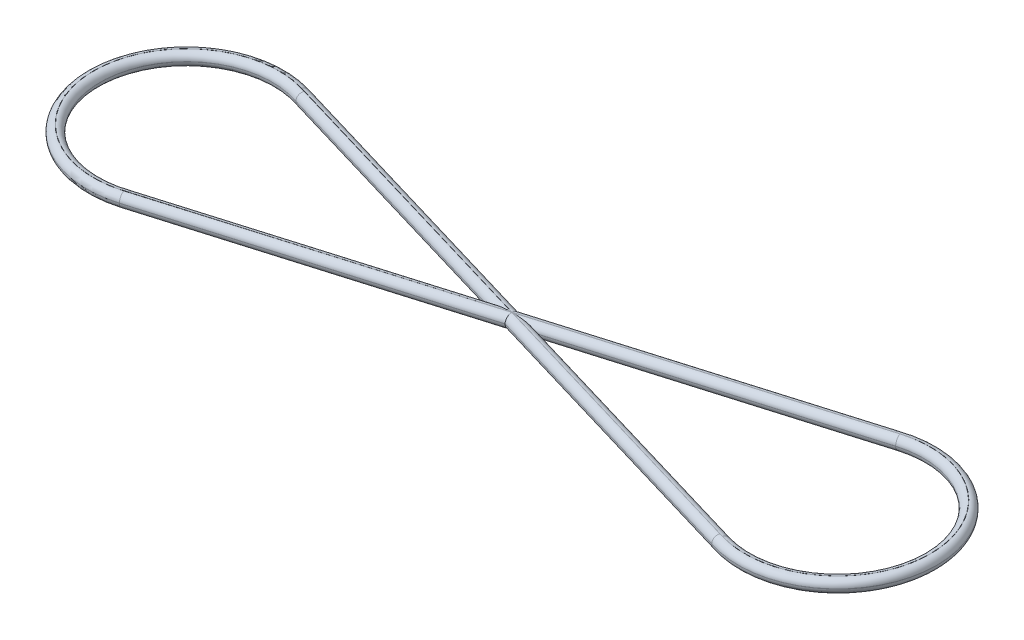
ISO-10303-21;
HEADER;
FILE_DESCRIPTION(('STEP AP214'),'2;1');
FILE_NAME('part.step','',(''),(''),'','','');
FILE_SCHEMA(('AUTOMOTIVE_DESIGN { 1 0 10303 214 1 1 1 1 }'));
ENDSEC;
DATA;
#1=APPLICATION_CONTEXT('core data for automotive mechanical design processes');
#2=APPLICATION_PROTOCOL_DEFINITION('international standard','automotive_design',2000,#1);
#3=PRODUCT_CONTEXT('',#1,'mechanical');
#4=PRODUCT('Part','Part','',(#3));
#5=PRODUCT_RELATED_PRODUCT_CATEGORY('part','',(#4));
#6=PRODUCT_DEFINITION_FORMATION('','',#4);
#7=PRODUCT_DEFINITION_CONTEXT('part definition',#1,'design');
#8=PRODUCT_DEFINITION('design','',#6,#7);
#9=PRODUCT_DEFINITION_SHAPE('','',#8);
#10=(LENGTH_UNIT() NAMED_UNIT(*) SI_UNIT(.MILLI.,.METRE.));
#11=(NAMED_UNIT(*) PLANE_ANGLE_UNIT() SI_UNIT($,.RADIAN.));
#12=(NAMED_UNIT(*) SI_UNIT($,.STERADIAN.) SOLID_ANGLE_UNIT());
#13=UNCERTAINTY_MEASURE_WITH_UNIT(LENGTH_MEASURE(1.E-05),#10,'distance_accuracy_value','');
#14=(GEOMETRIC_REPRESENTATION_CONTEXT(3) GLOBAL_UNCERTAINTY_ASSIGNED_CONTEXT((#13)) GLOBAL_UNIT_ASSIGNED_CONTEXT((#10,
#11,#12)) REPRESENTATION_CONTEXT('',''));
#15=CARTESIAN_POINT('',(0.,0.,0.));
#16=DIRECTION('',(0.,0.,1.));
#17=DIRECTION('',(1.,0.,0.));
#18=AXIS2_PLACEMENT_3D('',#15,#16,#17);
#19=CARTESIAN_POINT('',(-112.061328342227,5.,-72.3795131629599));
#20=DIRECTION('',(0.284552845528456,0.,-0.958660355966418));
#21=DIRECTION('',(-0.958660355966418,0.,-0.284552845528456));
#22=AXIS2_PLACEMENT_3D('',#19,#20,#21);
#23=PLANE('',#22);
#24=DIRECTION('',(0.,-1.,0.));
#25=VECTOR('',#24,1.);
#26=CARTESIAN_POINT('',(122.994961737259,5.,-2.60930123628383));
#27=LINE('',#26,#25);
#28=CARTESIAN_POINT('',(122.994961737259,2.53,-2.60930123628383));
#29=VERTEX_POINT('',#28);
#30=CARTESIAN_POINT('',(122.994961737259,2.47,-2.60930123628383));
#31=VERTEX_POINT('',#30);
#32=EDGE_CURVE('E475',#29,#31,#27,.T.);
#33=ORIENTED_EDGE('',*,*,#32,.T.);
#34=DIRECTION('',(0.958660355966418,0.,0.284552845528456));
#35=VECTOR('',#34,1.);
#36=CARTESIAN_POINT('',(10.6707317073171,2.47,-35.9497633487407));
#37=LINE('',#36,#35);
#38=CARTESIAN_POINT('',(10.6707317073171,2.47,-35.9497633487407));
#39=VERTEX_POINT('',#38);
#40=EDGE_CURVE('E242',#31,#39,#37,.F.);
#41=ORIENTED_EDGE('',*,*,#40,.T.);
#42=DIRECTION('',(0.,-1.,0.));
#43=VECTOR('',#42,1.);
#44=CARTESIAN_POINT('',(10.6707317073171,5.,-35.9497633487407));
#45=LINE('',#44,#43);
#46=CARTESIAN_POINT('',(10.6707317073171,2.53,-35.9497633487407));
#47=VERTEX_POINT('',#46);
#48=EDGE_CURVE('E209',#47,#39,#45,.T.);
#49=ORIENTED_EDGE('',*,*,#48,.F.);
#50=DIRECTION('',(0.958660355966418,0.,0.284552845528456));
#51=VECTOR('',#50,1.);
#52=CARTESIAN_POINT('',(-112.061328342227,2.53,-72.3795131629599));
#53=LINE('',#52,#51);
#54=EDGE_CURVE('E240',#47,#29,#53,.T.);
#55=ORIENTED_EDGE('',*,*,#54,.T.);
#56=EDGE_LOOP('',(#33,#41,#49,#55));
#57=FACE_BOUND('',#56,.T.);
#58=ADVANCED_FACE('F27',(#57),#23,.T.);
#59=CARTESIAN_POINT('',(0.,5.,0.));
#60=DIRECTION('',(0.,-1.,0.));
#61=DIRECTION('',(0.,0.,-1.));
#62=AXIS2_PLACEMENT_3D('',#59,#60,#61);
#63=CYLINDRICAL_SURFACE('',#62,37.5);
#64=ORIENTED_EDGE('',*,*,#48,.T.);
#65=CARTESIAN_POINT('',(0.,2.47,0.));
#66=DIRECTION('',(0.,1.,0.));
#67=DIRECTION('',(0.,0.,1.));
#68=AXIS2_PLACEMENT_3D('',#65,#66,#67);
#69=CIRCLE('',#68,37.5);
#70=CARTESIAN_POINT('',(10.6707317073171,2.47,35.9497633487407));
#71=VERTEX_POINT('',#70);
#72=EDGE_CURVE('E305',#39,#71,#69,.T.);
#73=ORIENTED_EDGE('',*,*,#72,.T.);
#74=DIRECTION('',(0.,-1.,0.));
#75=VECTOR('',#74,1.);
#76=CARTESIAN_POINT('',(10.6707317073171,5.,35.9497633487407));
#77=LINE('',#76,#75);
#78=CARTESIAN_POINT('',(10.6707317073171,2.53,35.9497633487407));
#79=VERTEX_POINT('',#78);
#80=EDGE_CURVE('E542',#79,#71,#77,.T.);
#81=ORIENTED_EDGE('',*,*,#80,.F.);
#82=CARTESIAN_POINT('',(0.,2.53,0.));
#83=DIRECTION('',(0.,1.,0.));
#84=DIRECTION('',(0.,0.,1.));
#85=AXIS2_PLACEMENT_3D('',#82,#83,#84);
#86=CIRCLE('',#85,37.5);
#87=EDGE_CURVE('E303',#79,#47,#86,.F.);
#88=ORIENTED_EDGE('',*,*,#87,.T.);
#89=EDGE_LOOP('',(#64,#73,#81,#88));
#90=FACE_BOUND('',#89,.T.);
#91=ADVANCED_FACE('F503',(#90),#63,.T.);
#92=CARTESIAN_POINT('',(-112.061328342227,5.,72.3795131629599));
#93=DIRECTION('',(-0.284552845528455,0.,-0.958660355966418));
#94=DIRECTION('',(-0.958660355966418,0.,0.284552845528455));
#95=AXIS2_PLACEMENT_3D('',#92,#93,#94);
#96=PLANE('',#95);
#97=ORIENTED_EDGE('',*,*,#80,.T.);
#98=DIRECTION('',(0.958660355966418,0.,-0.284552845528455));
#99=VECTOR('',#98,1.);
#100=CARTESIAN_POINT('',(-112.061328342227,2.47,72.3795131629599));
#101=LINE('',#100,#99);
#102=CARTESIAN_POINT('',(122.994961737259,2.47,2.60930123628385));
#103=VERTEX_POINT('',#102);
#104=EDGE_CURVE('E301',#71,#103,#101,.T.);
#105=ORIENTED_EDGE('',*,*,#104,.T.);
#106=DIRECTION('',(0.,-1.,0.));
#107=VECTOR('',#106,1.);
#108=CARTESIAN_POINT('',(122.994961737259,5.,2.60930123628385));
#109=LINE('',#108,#107);
#110=CARTESIAN_POINT('',(122.994961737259,2.53,2.60930123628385));
#111=VERTEX_POINT('',#110);
#112=EDGE_CURVE('E545',#111,#103,#109,.T.);
#113=ORIENTED_EDGE('',*,*,#112,.F.);
#114=DIRECTION('',(0.958660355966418,0.,-0.284552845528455));
#115=VECTOR('',#114,1.);
#116=CARTESIAN_POINT('',(10.6707317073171,2.53,35.9497633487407));
#117=LINE('',#116,#115);
#118=EDGE_CURVE('E299',#111,#79,#117,.F.);
#119=ORIENTED_EDGE('',*,*,#118,.T.);
#120=EDGE_LOOP('',(#97,#105,#113,#119));
#121=FACE_BOUND('',#120,.T.);
#122=ADVANCED_FACE('F499',(#121),#96,.F.);
#123=CARTESIAN_POINT('',(-113.521941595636,5.,-67.5252562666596));
#124=DIRECTION('',(0.284295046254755,0.,-0.958736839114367));
#125=DIRECTION('',(-0.958736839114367,0.,-0.284295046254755));
#126=AXIS2_PLACEMENT_3D('',#123,#124,#125);
#127=PLANE('',#126);
#128=DIRECTION('',(0.,-1.,0.));
#129=VECTOR('',#128,1.);
#130=CARTESIAN_POINT('',(233.942125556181,5.,35.5085576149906));
#131=LINE('',#130,#129);
#132=CARTESIAN_POINT('',(233.942125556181,2.53,35.5085576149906));
#133=VERTEX_POINT('',#132);
#134=CARTESIAN_POINT('',(233.942125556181,2.47,35.5085576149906));
#135=VERTEX_POINT('',#134);
#136=EDGE_CURVE('E548',#133,#135,#131,.T.);
#137=ORIENTED_EDGE('',*,*,#136,.F.);
#138=DIRECTION('',(0.958736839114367,0.,0.284295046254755));
#139=VECTOR('',#138,1.);
#140=CARTESIAN_POINT('',(122.994961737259,2.53,2.60930123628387));
#141=LINE('',#140,#139);
#142=EDGE_CURVE('E297',#133,#111,#141,.F.);
#143=ORIENTED_EDGE('',*,*,#142,.T.);
#144=ORIENTED_EDGE('',*,*,#112,.T.);
#145=DIRECTION('',(0.958736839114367,0.,0.284295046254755));
#146=VECTOR('',#145,1.);
#147=CARTESIAN_POINT('',(-113.521941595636,2.47,-67.5252562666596));
#148=LINE('',#147,#146);
#149=EDGE_CURVE('E295',#103,#135,#148,.T.);
#150=ORIENTED_EDGE('',*,*,#149,.T.);
#151=EDGE_LOOP('',(#137,#143,#144,#150));
#152=FACE_BOUND('',#151,.T.);
#153=ADVANCED_FACE('F495',(#152),#127,.F.);
#154=CARTESIAN_POINT('',(246.,5.,0.));
#155=DIRECTION('',(0.,-1.,0.));
#156=DIRECTION('',(0.,0.,-1.));
#157=AXIS2_PLACEMENT_3D('',#154,#155,#156);
#158=CYLINDRICAL_SURFACE('',#157,37.5);
#159=ORIENTED_EDGE('',*,*,#136,.T.);
#160=CARTESIAN_POINT('',(246.,2.47,0.));
#161=DIRECTION('',(0.,1.,0.));
#162=DIRECTION('',(0.,0.,1.));
#163=AXIS2_PLACEMENT_3D('',#160,#161,#162);
#164=CIRCLE('',#163,37.5);
#165=CARTESIAN_POINT('',(233.94212555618,2.47,-35.5085576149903));
#166=VERTEX_POINT('',#165);
#167=EDGE_CURVE('E257',#135,#166,#164,.T.);
#168=ORIENTED_EDGE('',*,*,#167,.T.);
#169=DIRECTION('',(0.,-1.,0.));
#170=VECTOR('',#169,1.);
#171=CARTESIAN_POINT('',(233.94212555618,5.,-35.5085576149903));
#172=LINE('',#171,#170);
#173=CARTESIAN_POINT('',(233.94212555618,2.53,-35.5085576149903));
#174=VERTEX_POINT('',#173);
#175=EDGE_CURVE('E550',#174,#166,#172,.T.);
#176=ORIENTED_EDGE('',*,*,#175,.F.);
#177=CARTESIAN_POINT('',(246.,2.53,0.));
#178=DIRECTION('',(0.,1.,0.));
#179=DIRECTION('',(0.,0.,1.));
#180=AXIS2_PLACEMENT_3D('',#177,#178,#179);
#181=CIRCLE('',#180,37.5);
#182=EDGE_CURVE('E254',#174,#133,#181,.F.);
#183=ORIENTED_EDGE('',*,*,#182,.T.);
#184=EDGE_LOOP('',(#159,#168,#176,#183));
#185=FACE_BOUND('',#184,.T.);
#186=ADVANCED_FACE('F491',(#185),#158,.T.);
#187=CARTESIAN_POINT('',(246.,5.,0.));
#188=DIRECTION('',(0.,-1.,0.));
#189=DIRECTION('',(0.,0.,-1.));
#190=AXIS2_PLACEMENT_3D('',#187,#188,#189);
#191=CYLINDRICAL_SURFACE('',#190,32.5);
#192=DIRECTION('',(0.,-1.,0.));
#193=VECTOR('',#192,1.);
#194=CARTESIAN_POINT('',(236.752032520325,5.,31.1564615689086));
#195=LINE('',#194,#193);
#196=CARTESIAN_POINT('',(236.752032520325,2.53,31.1564615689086));
#197=VERTEX_POINT('',#196);
#198=CARTESIAN_POINT('',(236.752032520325,2.47,31.1564615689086));
#199=VERTEX_POINT('',#198);
#200=EDGE_CURVE('E535',#197,#199,#195,.T.);
#201=ORIENTED_EDGE('',*,*,#200,.F.);
#202=CARTESIAN_POINT('',(246.,2.53,0.));
#203=DIRECTION('',(0.,1.,0.));
#204=DIRECTION('',(0.,0.,1.));
#205=AXIS2_PLACEMENT_3D('',#202,#203,#204);
#206=CIRCLE('',#205,32.5);
#207=CARTESIAN_POINT('',(236.752032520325,2.53,-31.1564615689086));
#208=VERTEX_POINT('',#207);
#209=EDGE_CURVE('E288',#197,#208,#206,.T.);
#210=ORIENTED_EDGE('',*,*,#209,.T.);
#211=DIRECTION('',(0.,-1.,0.));
#212=VECTOR('',#211,1.);
#213=CARTESIAN_POINT('',(236.752032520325,5.,-31.1564615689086));
#214=LINE('',#213,#212);
#215=CARTESIAN_POINT('',(236.752032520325,2.47,-31.1564615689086));
#216=VERTEX_POINT('',#215);
#217=EDGE_CURVE('E528',#208,#216,#214,.T.);
#218=ORIENTED_EDGE('',*,*,#217,.T.);
#219=CARTESIAN_POINT('',(246.,2.47,0.));
#220=DIRECTION('',(0.,1.,0.));
#221=DIRECTION('',(0.,0.,1.));
#222=AXIS2_PLACEMENT_3D('',#219,#220,#221);
#223=CIRCLE('',#222,32.5);
#224=EDGE_CURVE('E286',#216,#199,#223,.F.);
#225=ORIENTED_EDGE('',*,*,#224,.T.);
#226=EDGE_LOOP('',(#201,#210,#218,#225));
#227=FACE_BOUND('',#226,.T.);
#228=ADVANCED_FACE('F494',(#227),#191,.F.);
#229=CARTESIAN_POINT('',(-112.061328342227,5.,-72.3795131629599));
#230=DIRECTION('',(0.284552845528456,0.,-0.958660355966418));
#231=DIRECTION('',(-0.958660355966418,0.,-0.284552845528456));
#232=AXIS2_PLACEMENT_3D('',#229,#230,#231);
#233=PLANE('',#232);
#234=ORIENTED_EDGE('',*,*,#200,.T.);
#235=DIRECTION('',(0.958660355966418,0.,0.284552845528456));
#236=VECTOR('',#235,1.);
#237=CARTESIAN_POINT('',(131.785714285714,2.47,0.));
#238=LINE('',#237,#236);
#239=CARTESIAN_POINT('',(131.785714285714,2.47,0.));
#240=VERTEX_POINT('',#239);
#241=EDGE_CURVE('E251',#199,#240,#238,.F.);
#242=ORIENTED_EDGE('',*,*,#241,.T.);
#243=DIRECTION('',(0.,-1.,0.));
#244=VECTOR('',#243,1.);
#245=CARTESIAN_POINT('',(131.785714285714,5.,0.));
#246=LINE('',#245,#244);
#247=CARTESIAN_POINT('',(131.785714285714,2.53,0.));
#248=VERTEX_POINT('',#247);
#249=EDGE_CURVE('E531',#248,#240,#246,.T.);
#250=ORIENTED_EDGE('',*,*,#249,.F.);
#251=DIRECTION('',(0.958660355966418,0.,0.284552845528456));
#252=VECTOR('',#251,1.);
#253=CARTESIAN_POINT('',(-112.061328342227,2.53,-72.3795131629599));
#254=LINE('',#253,#252);
#255=EDGE_CURVE('E249',#248,#197,#254,.T.);
#256=ORIENTED_EDGE('',*,*,#255,.T.);
#257=EDGE_LOOP('',(#234,#242,#250,#256));
#258=FACE_BOUND('',#257,.T.);
#259=ADVANCED_FACE('F516',(#258),#233,.T.);
#260=CARTESIAN_POINT('',(0.,5.,0.));
#261=DIRECTION('',(0.,-1.,0.));
#262=DIRECTION('',(0.,0.,-1.));
#263=AXIS2_PLACEMENT_3D('',#260,#261,#262);
#264=CYLINDRICAL_SURFACE('',#263,32.5);
#265=DIRECTION('',(0.,-1.,0.));
#266=VECTOR('',#265,1.);
#267=CARTESIAN_POINT('',(10.6707317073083,5.,30.6982977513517));
#268=LINE('',#267,#266);
#269=CARTESIAN_POINT('',(10.6707317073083,2.53,30.6982977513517));
#270=VERTEX_POINT('',#269);
#271=CARTESIAN_POINT('',(10.6707317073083,2.47,30.6982977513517));
#272=VERTEX_POINT('',#271);
#273=EDGE_CURVE('E311',#270,#272,#268,.T.);
#274=ORIENTED_EDGE('',*,*,#273,.T.);
#275=CARTESIAN_POINT('',(0.,2.47,0.));
#276=DIRECTION('',(0.,1.,0.));
#277=DIRECTION('',(0.,0.,1.));
#278=AXIS2_PLACEMENT_3D('',#275,#276,#277);
#279=CIRCLE('',#278,32.5);
#280=CARTESIAN_POINT('',(10.6707317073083,2.47,-30.6982977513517));
#281=VERTEX_POINT('',#280);
#282=EDGE_CURVE('E42',#272,#281,#279,.F.);
#283=ORIENTED_EDGE('',*,*,#282,.T.);
#284=DIRECTION('',(0.,-1.,0.));
#285=VECTOR('',#284,1.);
#286=CARTESIAN_POINT('',(10.6707317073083,5.,-30.6982977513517));
#287=LINE('',#286,#285);
#288=CARTESIAN_POINT('',(10.6707317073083,2.53,-30.6982977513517));
#289=VERTEX_POINT('',#288);
#290=EDGE_CURVE('E312',#289,#281,#287,.T.);
#291=ORIENTED_EDGE('',*,*,#290,.F.);
#292=CARTESIAN_POINT('',(0.,2.53,0.));
#293=DIRECTION('',(0.,1.,0.));
#294=DIRECTION('',(0.,0.,1.));
#295=AXIS2_PLACEMENT_3D('',#292,#293,#294);
#296=CIRCLE('',#295,32.5);
#297=EDGE_CURVE('E307',#289,#270,#296,.T.);
#298=ORIENTED_EDGE('',*,*,#297,.T.);
#299=EDGE_LOOP('',(#274,#283,#291,#298));
#300=FACE_BOUND('',#299,.T.);
#301=ADVANCED_FACE('F29',(#300),#264,.F.);
#302=CARTESIAN_POINT('',(-113.521941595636,5.,-67.5252562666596));
#303=DIRECTION('',(0.284295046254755,0.,-0.958736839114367));
#304=DIRECTION('',(-0.958736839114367,0.,-0.284295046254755));
#305=AXIS2_PLACEMENT_3D('',#302,#303,#304);
#306=PLANE('',#305);
#307=ORIENTED_EDGE('',*,*,#290,.T.);
#308=DIRECTION('',(0.958736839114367,0.,0.284295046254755));
#309=VECTOR('',#308,1.);
#310=CARTESIAN_POINT('',(-113.521941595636,2.47,-67.5252562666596));
#311=LINE('',#310,#309);
#312=CARTESIAN_POINT('',(114.195535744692,2.47,0.));
#313=VERTEX_POINT('',#312);
#314=EDGE_CURVE('E11',#281,#313,#311,.T.);
#315=ORIENTED_EDGE('',*,*,#314,.T.);
#316=DIRECTION('',(0.,-1.,0.));
#317=VECTOR('',#316,1.);
#318=CARTESIAN_POINT('',(114.195535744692,5.,0.));
#319=LINE('',#318,#317);
#320=CARTESIAN_POINT('',(114.195535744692,2.53,0.));
#321=VERTEX_POINT('',#320);
#322=EDGE_CURVE('E321',#321,#313,#319,.T.);
#323=ORIENTED_EDGE('',*,*,#322,.F.);
#324=DIRECTION('',(0.958736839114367,0.,0.284295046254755));
#325=VECTOR('',#324,1.);
#326=CARTESIAN_POINT('',(10.6707317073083,2.53,-30.6982977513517));
#327=LINE('',#326,#325);
#328=EDGE_CURVE('E35',#321,#289,#327,.F.);
#329=ORIENTED_EDGE('',*,*,#328,.T.);
#330=EDGE_LOOP('',(#307,#315,#323,#329));
#331=FACE_BOUND('',#330,.T.);
#332=ADVANCED_FACE('F514',(#331),#306,.F.);
#333=CARTESIAN_POINT('',(-112.061328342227,5.,72.3795131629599));
#334=DIRECTION('',(-0.284552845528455,0.,-0.958660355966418));
#335=DIRECTION('',(-0.958660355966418,0.,0.284552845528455));
#336=AXIS2_PLACEMENT_3D('',#333,#334,#335);
#337=PLANE('',#336);
#338=ORIENTED_EDGE('',*,*,#249,.T.);
#339=DIRECTION('',(0.958660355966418,0.,-0.284552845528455));
#340=VECTOR('',#339,1.);
#341=CARTESIAN_POINT('',(-112.061328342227,2.47,72.3795131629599));
#342=LINE('',#341,#340);
#343=EDGE_CURVE('E293',#240,#216,#342,.T.);
#344=ORIENTED_EDGE('',*,*,#343,.T.);
#345=ORIENTED_EDGE('',*,*,#217,.F.);
#346=DIRECTION('',(0.958660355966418,0.,-0.284552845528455));
#347=VECTOR('',#346,1.);
#348=CARTESIAN_POINT('',(131.785714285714,2.53,0.));
#349=LINE('',#348,#347);
#350=EDGE_CURVE('E291',#208,#248,#349,.F.);
#351=ORIENTED_EDGE('',*,*,#350,.T.);
#352=EDGE_LOOP('',(#338,#344,#345,#351));
#353=FACE_BOUND('',#352,.T.);
#354=ADVANCED_FACE('F511',(#353),#337,.F.);
#355=CARTESIAN_POINT('',(-113.521941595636,5.,67.5252562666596));
#356=DIRECTION('',(-0.284295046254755,0.,-0.958736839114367));
#357=DIRECTION('',(-0.958736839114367,0.,0.284295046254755));
#358=AXIS2_PLACEMENT_3D('',#355,#356,#357);
#359=PLANE('',#358);
#360=ORIENTED_EDGE('',*,*,#322,.T.);
#361=DIRECTION('',(0.958736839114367,0.,-0.284295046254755));
#362=VECTOR('',#361,1.);
#363=CARTESIAN_POINT('',(10.6707317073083,2.47,30.6982977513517));
#364=LINE('',#363,#362);
#365=EDGE_CURVE('E195',#313,#272,#364,.F.);
#366=ORIENTED_EDGE('',*,*,#365,.T.);
#367=ORIENTED_EDGE('',*,*,#273,.F.);
#368=DIRECTION('',(0.958736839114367,0.,-0.284295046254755));
#369=VECTOR('',#368,1.);
#370=CARTESIAN_POINT('',(-113.521941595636,2.53,67.5252562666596));
#371=LINE('',#370,#369);
#372=EDGE_CURVE('E236',#270,#321,#371,.T.);
#373=ORIENTED_EDGE('',*,*,#372,.T.);
#374=EDGE_LOOP('',(#360,#366,#367,#373));
#375=FACE_BOUND('',#374,.T.);
#376=ADVANCED_FACE('F319',(#375),#359,.T.);
#377=CARTESIAN_POINT('',(-113.521941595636,5.,67.5252562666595));
#378=DIRECTION('',(-0.284295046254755,0.,-0.958736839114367));
#379=DIRECTION('',(-0.958736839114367,0.,0.284295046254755));
#380=AXIS2_PLACEMENT_3D('',#377,#378,#379);
#381=PLANE('',#380);
#382=ORIENTED_EDGE('',*,*,#175,.T.);
#383=DIRECTION('',(0.958736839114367,0.,-0.284295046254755));
#384=VECTOR('',#383,1.);
#385=CARTESIAN_POINT('',(122.994961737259,2.47,-2.60930123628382));
#386=LINE('',#385,#384);
#387=EDGE_CURVE('E247',#166,#31,#386,.F.);
#388=ORIENTED_EDGE('',*,*,#387,.T.);
#389=ORIENTED_EDGE('',*,*,#32,.F.);
#390=DIRECTION('',(0.958736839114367,0.,-0.284295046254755));
#391=VECTOR('',#390,1.);
#392=CARTESIAN_POINT('',(-113.521941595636,2.53,67.5252562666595));
#393=LINE('',#392,#391);
#394=EDGE_CURVE('E245',#29,#174,#393,.T.);
#395=ORIENTED_EDGE('',*,*,#394,.T.);
#396=EDGE_LOOP('',(#382,#388,#389,#395));
#397=FACE_BOUND('',#396,.T.);
#398=ADVANCED_FACE('F486',(#397),#381,.T.);
#399=CARTESIAN_POINT('',(-133.545262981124,5.,0.));
#400=DIRECTION('',(0.,1.,0.));
#401=DIRECTION('',(0.,0.,1.));
#402=AXIS2_PLACEMENT_3D('',#399,#400,#401);
#403=PLANE('',#402);
#404=DIRECTION('',(0.958660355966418,0.,-0.284552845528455));
#405=VECTOR('',#404,1.);
#406=CARTESIAN_POINT('',(236.04918699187,5.,-33.5243526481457));
#407=LINE('',#406,#405);
#408=CARTESIAN_POINT('',(123.105428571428,5.,0.));
#409=VERTEX_POINT('',#408);
#410=CARTESIAN_POINT('',(236.04918699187,5.,-33.5243526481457));
#411=VERTEX_POINT('',#410);
#412=EDGE_CURVE('E281',#409,#411,#407,.T.);
#413=ORIENTED_EDGE('',*,*,#412,.T.);
#414=CARTESIAN_POINT('',(246.,5.,0.));
#415=DIRECTION('',(0.,1.,0.));
#416=DIRECTION('',(0.,0.,1.));
#417=AXIS2_PLACEMENT_3D('',#414,#415,#416);
#418=CIRCLE('',#417,34.97);
#419=CARTESIAN_POINT('',(236.04918699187,5.,33.5243526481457));
#420=VERTEX_POINT('',#419);
#421=EDGE_CURVE('E283',#411,#420,#418,.F.);
#422=ORIENTED_EDGE('',*,*,#421,.T.);
#423=DIRECTION('',(0.958660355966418,0.,0.284552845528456));
#424=VECTOR('',#423,1.);
#425=CARTESIAN_POINT('',(-112.764173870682,5.,-70.0116220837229));
#426=LINE('',#425,#424);
#427=EDGE_CURVE('E279',#420,#409,#426,.F.);
#428=ORIENTED_EDGE('',*,*,#427,.T.);
#429=EDGE_LOOP('',(#413,#422,#428));
#430=FACE_BOUND('',#429,.T.);
#431=DIRECTION('',(0.958736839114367,0.,0.284295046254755));
#432=VECTOR('',#431,1.);
#433=CARTESIAN_POINT('',(234.644334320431,5.,33.1404776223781));
#434=LINE('',#433,#432);
#435=CARTESIAN_POINT('',(122.994615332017,5.,0.0328919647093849));
#436=VERTEX_POINT('',#435);
#437=CARTESIAN_POINT('',(234.691410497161,5.,33.1544371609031));
#438=VERTEX_POINT('',#437);
#439=EDGE_CURVE('E272',#436,#438,#434,.T.);
#440=ORIENTED_EDGE('',*,*,#439,.T.);
#441=CARTESIAN_POINT('',(246.,5.,0.));
#442=DIRECTION('',(0.,1.,0.));
#443=DIRECTION('',(0.,0.,1.));
#444=AXIS2_PLACEMENT_3D('',#441,#442,#443);
#445=CIRCLE('',#444,35.03);
#446=CARTESIAN_POINT('',(234.69141049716,5.,-33.154437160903));
#447=VERTEX_POINT('',#446);
#448=EDGE_CURVE('E276',#438,#447,#445,.T.);
#449=ORIENTED_EDGE('',*,*,#448,.T.);
#450=DIRECTION('',(0.958736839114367,0.,-0.284295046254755));
#451=VECTOR('',#450,1.);
#452=CARTESIAN_POINT('',(-112.819732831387,5.,69.893336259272));
#453=LINE('',#452,#451);
#454=CARTESIAN_POINT('',(122.994615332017,5.,-0.0328919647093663));
#455=VERTEX_POINT('',#454);
#456=EDGE_CURVE('E274',#447,#455,#453,.F.);
#457=ORIENTED_EDGE('',*,*,#456,.T.);
#458=DIRECTION('',(0.958660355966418,0.,0.284552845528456));
#459=VECTOR('',#458,1.);
#460=CARTESIAN_POINT('',(-112.764173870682,5.,-70.0116220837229));
#461=LINE('',#460,#459);
#462=CARTESIAN_POINT('',(9.96788617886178,5.,-33.5818722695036));
#463=VERTEX_POINT('',#462);
#464=EDGE_CURVE('E270',#455,#463,#461,.F.);
#465=ORIENTED_EDGE('',*,*,#464,.T.);
#466=CARTESIAN_POINT('',(0.,5.,0.));
#467=DIRECTION('',(0.,1.,0.));
#468=DIRECTION('',(0.,0.,1.));
#469=AXIS2_PLACEMENT_3D('',#466,#467,#468);
#470=CIRCLE('',#469,35.03);
#471=CARTESIAN_POINT('',(9.96788617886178,5.,33.5818722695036));
#472=VERTEX_POINT('',#471);
#473=EDGE_CURVE('E268',#463,#472,#470,.T.);
#474=ORIENTED_EDGE('',*,*,#473,.T.);
#475=DIRECTION('',(0.958660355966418,0.,-0.284552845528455));
#476=VECTOR('',#475,1.);
#477=CARTESIAN_POINT('',(122.292116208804,5.,0.241410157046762));
#478=LINE('',#477,#476);
#479=EDGE_CURVE('E266',#472,#436,#478,.T.);
#480=ORIENTED_EDGE('',*,*,#479,.T.);
#481=EDGE_LOOP('',(#440,#449,#457,#465,#474,#480));
#482=FACE_BOUND('',#481,.T.);
#483=DIRECTION('',(0.958736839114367,0.,0.284295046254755));
#484=VECTOR('',#483,1.);
#485=CARTESIAN_POINT('',(114.897744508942,5.,-2.36807999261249));
#486=LINE('',#485,#484);
#487=CARTESIAN_POINT('',(11.4267251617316,5.,-33.0504289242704));
#488=VERTEX_POINT('',#487);
#489=CARTESIAN_POINT('',(122.883692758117,5.,0.));
#490=VERTEX_POINT('',#489);
#491=EDGE_CURVE('E261',#488,#490,#486,.T.);
#492=ORIENTED_EDGE('',*,*,#491,.T.);
#493=DIRECTION('',(0.958736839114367,0.,-0.284295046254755));
#494=VECTOR('',#493,1.);
#495=CARTESIAN_POINT('',(-112.819732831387,5.,69.8933362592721));
#496=LINE('',#495,#494);
#497=CARTESIAN_POINT('',(11.4267251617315,5.,33.0504289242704));
#498=VERTEX_POINT('',#497);
#499=EDGE_CURVE('E263',#490,#498,#496,.F.);
#500=ORIENTED_EDGE('',*,*,#499,.T.);
#501=CARTESIAN_POINT('',(0.,5.,0.));
#502=DIRECTION('',(0.,1.,0.));
#503=DIRECTION('',(0.,0.,1.));
#504=AXIS2_PLACEMENT_3D('',#501,#502,#503);
#505=CIRCLE('',#504,34.97);
#506=EDGE_CURVE('E259',#498,#488,#505,.F.);
#507=ORIENTED_EDGE('',*,*,#506,.T.);
#508=EDGE_LOOP('',(#492,#500,#507));
#509=FACE_BOUND('',#508,.T.);
#510=ADVANCED_FACE('F482',(#430,#482,#509),#403,.T.);
#511=CARTESIAN_POINT('',(-133.545262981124,0.,0.));
#512=DIRECTION('',(0.,1.,0.));
#513=DIRECTION('',(0.,0.,1.));
#514=AXIS2_PLACEMENT_3D('',#511,#512,#513);
#515=PLANE('',#514);
#516=DIRECTION('',(0.958660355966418,0.,-0.284552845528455));
#517=VECTOR('',#516,1.);
#518=CARTESIAN_POINT('',(-112.764173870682,0.,70.0116220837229));
#519=LINE('',#518,#517);
#520=CARTESIAN_POINT('',(236.04918699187,0.,-33.5243526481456));
#521=VERTEX_POINT('',#520);
#522=CARTESIAN_POINT('',(123.105428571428,0.,0.));
#523=VERTEX_POINT('',#522);
#524=EDGE_CURVE('E229',#521,#523,#519,.F.);
#525=ORIENTED_EDGE('',*,*,#524,.T.);
#526=DIRECTION('',(0.958660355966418,0.,0.284552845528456));
#527=VECTOR('',#526,1.);
#528=CARTESIAN_POINT('',(236.04918699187,0.,33.5243526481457));
#529=LINE('',#528,#527);
#530=CARTESIAN_POINT('',(236.04918699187,0.,33.5243526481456));
#531=VERTEX_POINT('',#530);
#532=EDGE_CURVE('E233',#523,#531,#529,.T.);
#533=ORIENTED_EDGE('',*,*,#532,.T.);
#534=CARTESIAN_POINT('',(246.,0.,0.));
#535=DIRECTION('',(0.,1.,0.));
#536=DIRECTION('',(0.,0.,1.));
#537=AXIS2_PLACEMENT_3D('',#534,#535,#536);
#538=CIRCLE('',#537,34.97);
#539=EDGE_CURVE('E231',#531,#521,#538,.T.);
#540=ORIENTED_EDGE('',*,*,#539,.T.);
#541=EDGE_LOOP('',(#525,#533,#540));
#542=FACE_BOUND('',#541,.T.);
#543=CARTESIAN_POINT('',(0.,0.,0.));
#544=DIRECTION('',(0.,1.,0.));
#545=DIRECTION('',(0.,0.,1.));
#546=AXIS2_PLACEMENT_3D('',#543,#544,#545);
#547=CIRCLE('',#546,35.03);
#548=CARTESIAN_POINT('',(9.96788617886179,0.,33.5818722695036));
#549=VERTEX_POINT('',#548);
#550=CARTESIAN_POINT('',(9.96788617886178,0.,-33.5818722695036));
#551=VERTEX_POINT('',#550);
#552=EDGE_CURVE('E213',#549,#551,#547,.F.);
#553=ORIENTED_EDGE('',*,*,#552,.T.);
#554=DIRECTION('',(0.958660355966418,0.,0.284552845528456));
#555=VECTOR('',#554,1.);
#556=CARTESIAN_POINT('',(122.292116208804,0.,-0.241410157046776));
#557=LINE('',#556,#555);
#558=CARTESIAN_POINT('',(122.994615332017,0.,-0.0328919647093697));
#559=VERTEX_POINT('',#558);
#560=EDGE_CURVE('E226',#551,#559,#557,.T.);
#561=ORIENTED_EDGE('',*,*,#560,.T.);
#562=DIRECTION('',(0.958736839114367,0.,-0.284295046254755));
#563=VECTOR('',#562,1.);
#564=CARTESIAN_POINT('',(234.64433432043,0.,-33.1404776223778));
#565=LINE('',#564,#563);
#566=CARTESIAN_POINT('',(234.69141049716,0.,-33.1544371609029));
#567=VERTEX_POINT('',#566);
#568=EDGE_CURVE('E224',#559,#567,#565,.T.);
#569=ORIENTED_EDGE('',*,*,#568,.T.);
#570=CARTESIAN_POINT('',(246.,0.,0.));
#571=DIRECTION('',(0.,1.,0.));
#572=DIRECTION('',(0.,0.,1.));
#573=AXIS2_PLACEMENT_3D('',#570,#571,#572);
#574=CIRCLE('',#573,35.03);
#575=CARTESIAN_POINT('',(234.69141049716,0.,33.154437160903));
#576=VERTEX_POINT('',#575);
#577=EDGE_CURVE('E222',#567,#576,#574,.F.);
#578=ORIENTED_EDGE('',*,*,#577,.T.);
#579=DIRECTION('',(0.958736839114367,0.,0.284295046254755));
#580=VECTOR('',#579,1.);
#581=CARTESIAN_POINT('',(-112.819732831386,0.,-69.8933362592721));
#582=LINE('',#581,#580);
#583=CARTESIAN_POINT('',(122.994615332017,0.,0.0328919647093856));
#584=VERTEX_POINT('',#583);
#585=EDGE_CURVE('E220',#576,#584,#582,.F.);
#586=ORIENTED_EDGE('',*,*,#585,.T.);
#587=DIRECTION('',(0.958660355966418,0.,-0.284552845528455));
#588=VECTOR('',#587,1.);
#589=CARTESIAN_POINT('',(-112.764173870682,0.,70.0116220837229));
#590=LINE('',#589,#588);
#591=EDGE_CURVE('E215',#584,#549,#590,.F.);
#592=ORIENTED_EDGE('',*,*,#591,.T.);
#593=EDGE_LOOP('',(#553,#561,#569,#578,#586,#592));
#594=FACE_BOUND('',#593,.T.);
#595=CARTESIAN_POINT('',(0.,0.,0.));
#596=DIRECTION('',(0.,1.,0.));
#597=DIRECTION('',(0.,0.,1.));
#598=AXIS2_PLACEMENT_3D('',#595,#596,#597);
#599=CIRCLE('',#598,34.97);
#600=CARTESIAN_POINT('',(11.4267251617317,0.,-33.0504289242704));
#601=VERTEX_POINT('',#600);
#602=CARTESIAN_POINT('',(11.4267251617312,0.,33.0504289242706));
#603=VERTEX_POINT('',#602);
#604=EDGE_CURVE('E208',#601,#603,#599,.T.);
#605=ORIENTED_EDGE('',*,*,#604,.T.);
#606=DIRECTION('',(0.958736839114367,0.,-0.284295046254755));
#607=VECTOR('',#606,1.);
#608=CARTESIAN_POINT('',(114.897744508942,0.,2.3680799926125));
#609=LINE('',#608,#607);
#610=CARTESIAN_POINT('',(122.883692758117,0.,0.));
#611=VERTEX_POINT('',#610);
#612=EDGE_CURVE('E193',#603,#611,#609,.T.);
#613=ORIENTED_EDGE('',*,*,#612,.T.);
#614=DIRECTION('',(0.958736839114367,0.,0.284295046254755));
#615=VECTOR('',#614,1.);
#616=CARTESIAN_POINT('',(-112.819732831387,0.,-69.8933362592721));
#617=LINE('',#616,#615);
#618=EDGE_CURVE('E202',#611,#601,#617,.F.);
#619=ORIENTED_EDGE('',*,*,#618,.T.);
#620=EDGE_LOOP('',(#605,#613,#619));
#621=FACE_BOUND('',#620,.T.);
#622=ADVANCED_FACE('F211',(#542,#594,#621),#515,.F.);
#623=CARTESIAN_POINT('',(0.,2.47,0.));
#624=DIRECTION('',(0.,1.,0.));
#625=DIRECTION('',(0.,0.,1.));
#626=AXIS2_PLACEMENT_3D('',#623,#624,#625);
#627=TOROIDAL_SURFACE('',#626,34.97,2.47);
#628=CARTESIAN_POINT('',(10.6707317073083,2.47,30.6982977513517));
#629=CARTESIAN_POINT('',(10.6707296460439,2.40054299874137,30.6982914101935));
#630=CARTESIAN_POINT('',(10.6716295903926,2.33108916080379,30.7010872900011));
#631=CARTESIAN_POINT('',(10.675217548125,2.19267847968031,30.7122344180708));
#632=CARTESIAN_POINT('',(10.6779054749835,2.12372161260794,30.7205853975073));
#633=CARTESIAN_POINT('',(10.6850509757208,1.98683628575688,30.7427859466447));
#634=CARTESIAN_POINT('',(10.6895073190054,1.91890714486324,30.7566316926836));
#635=CARTESIAN_POINT('',(10.7001531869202,1.78453226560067,30.7897093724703));
#636=CARTESIAN_POINT('',(10.7063426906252,1.7180865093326,30.808941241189));
#637=CARTESIAN_POINT('',(10.7274602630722,1.52161616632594,30.8745602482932));
#638=CARTESIAN_POINT('',(10.7449403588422,1.39440200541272,30.9288800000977));
#639=CARTESIAN_POINT('',(10.7861761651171,1.1514592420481,31.057039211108));
#640=CARTESIAN_POINT('',(10.8099303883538,1.03572792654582,31.1308740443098));
#641=CARTESIAN_POINT('',(10.8630456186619,0.818897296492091,31.2959997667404));
#642=CARTESIAN_POINT('',(10.8924070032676,0.717798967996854,31.3872918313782));
#643=CARTESIAN_POINT('',(10.955908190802,0.533101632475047,31.5847725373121));
#644=CARTESIAN_POINT('',(10.9900496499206,0.449508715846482,31.6909663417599));
#645=CARTESIAN_POINT('',(11.0621431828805,0.30219143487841,31.9152553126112));
#646=CARTESIAN_POINT('',(11.100097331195,0.23847796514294,32.0333569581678));
#647=CARTESIAN_POINT('',(11.178706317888,0.13283286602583,32.2780202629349));
#648=CARTESIAN_POINT('',(11.2193585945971,0.0908809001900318,32.4045738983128));
#649=CARTESIAN_POINT('',(11.285653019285,0.0420381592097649,32.6110017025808));
#650=CARTESIAN_POINT('',(11.3108211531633,0.0278375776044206,32.6893810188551));
#651=CARTESIAN_POINT('',(11.36143717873,0.00784310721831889,32.8470328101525));
#652=CARTESIAN_POINT('',(11.3868846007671,0.00203679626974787,32.9263037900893));
#653=CARTESIAN_POINT('',(11.4171343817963,0.000149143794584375,33.0205475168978));
#654=CARTESIAN_POINT('',(11.4219301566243,-3.98044068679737E-07,33.0354892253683));
#655=CARTESIAN_POINT('',(11.4267251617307,0.,33.0504289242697));
#656=B_SPLINE_CURVE_WITH_KNOTS('',3,(#628,#629,#630,#631,#632,#633,#634,#635,#636,#637,#638,
#639,#640,#641,#642,#643,#644,#645,#646,#647,#648,#649,#650,#651,#652,#653,#654,#655),
.UNSPECIFIED.,.F.,.F.,(4,2,2,2,2,2,2,2,2,2,2,2,2,4),(0.,0.208303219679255,0.416596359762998,
0.624744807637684,0.832890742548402,1.24901281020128,1.66503632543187,2.08108786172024,
2.49728390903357,2.91370764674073,3.32974152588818,3.5799888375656,3.82986544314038,
3.87694172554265),.UNSPECIFIED.);
#657=EDGE_CURVE('E198',#603,#272,#656,.F.);
#658=ORIENTED_EDGE('',*,*,#657,.F.);
#659=ORIENTED_EDGE('',*,*,#604,.F.);
#660=CARTESIAN_POINT('',(10.6707317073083,2.47,-30.6982977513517));
#661=CARTESIAN_POINT('',(10.670729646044,2.40054299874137,-30.6982914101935));
#662=CARTESIAN_POINT('',(10.6716295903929,2.33108916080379,-30.701087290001));
#663=CARTESIAN_POINT('',(10.6752175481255,2.19267847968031,-30.7122344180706));
#664=CARTESIAN_POINT('',(10.6779054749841,2.12372161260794,-30.7205853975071));
#665=CARTESIAN_POINT('',(10.6850509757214,1.98683628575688,-30.7427859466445));
#666=CARTESIAN_POINT('',(10.6895073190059,1.91890714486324,-30.7566316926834));
#667=CARTESIAN_POINT('',(10.7001531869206,1.78453226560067,-30.7897093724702));
#668=CARTESIAN_POINT('',(10.7063426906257,1.7180865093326,-30.8089412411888));
#669=CARTESIAN_POINT('',(10.7274602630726,1.52161616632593,-30.874560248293));
#670=CARTESIAN_POINT('',(10.7449403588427,1.39440200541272,-30.9288800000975));
#671=CARTESIAN_POINT('',(10.7861761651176,1.1514592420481,-31.0570392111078));
#672=CARTESIAN_POINT('',(10.8099303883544,1.03572792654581,-31.1308740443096));
#673=CARTESIAN_POINT('',(10.8630456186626,0.818897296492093,-31.2959997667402));
#674=CARTESIAN_POINT('',(10.8924070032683,0.717798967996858,-31.387291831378));
#675=CARTESIAN_POINT('',(10.9559081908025,0.53310163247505,-31.5847725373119));
#676=CARTESIAN_POINT('',(10.9900496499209,0.449508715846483,-31.6909663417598));
#677=CARTESIAN_POINT('',(11.0621431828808,0.30219143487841,-31.9152553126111));
#678=CARTESIAN_POINT('',(11.1000973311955,0.238477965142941,-32.0333569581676));
#679=CARTESIAN_POINT('',(11.1787063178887,0.132832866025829,-32.2780202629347));
#680=CARTESIAN_POINT('',(11.2193585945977,0.09088090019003,-32.4045738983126));
#681=CARTESIAN_POINT('',(11.2856530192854,0.0420381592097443,-32.6110017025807));
#682=CARTESIAN_POINT('',(11.3108211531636,0.0278375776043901,-32.6893810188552));
#683=CARTESIAN_POINT('',(11.3614371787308,0.00784310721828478,-32.8470328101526));
#684=CARTESIAN_POINT('',(11.3868846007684,0.00203679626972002,-32.9263037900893));
#685=CARTESIAN_POINT('',(11.4171343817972,0.000149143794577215,-33.0205475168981));
#686=CARTESIAN_POINT('',(11.4219301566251,-3.98044072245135E-07,-33.0354892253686));
#687=CARTESIAN_POINT('',(11.4267251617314,0.,-33.05042892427));
#688=B_SPLINE_CURVE_WITH_KNOTS('',3,(#660,#661,#662,#663,#664,#665,#666,#667,#668,#669,#670,
#671,#672,#673,#674,#675,#676,#677,#678,#679,#680,#681,#682,#683,#684,#685,#686,#687),
.UNSPECIFIED.,.F.,.F.,(4,2,2,2,2,2,2,2,2,2,2,2,2,4),(0.,0.208303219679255,0.416596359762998,
0.624744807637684,0.832890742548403,1.24901281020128,1.66503632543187,2.08108786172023,
2.49728390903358,2.91370764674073,3.32974152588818,3.57998883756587,3.82986544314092,
3.87694172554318),.UNSPECIFIED.);
#689=EDGE_CURVE('E205',#281,#601,#688,.T.);
#690=ORIENTED_EDGE('',*,*,#689,.F.);
#691=ORIENTED_EDGE('',*,*,#282,.F.);
#692=EDGE_LOOP('',(#658,#659,#690,#691));
#693=FACE_BOUND('',#692,.T.);
#694=ADVANCED_FACE('F458',(#693),#627,.T.);
#695=CARTESIAN_POINT('',(-112.819732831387,2.47,-69.8933362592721));
#696=DIRECTION('',(0.958736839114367,0.,0.284295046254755));
#697=DIRECTION('',(0.284295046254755,0.,-0.958736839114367));
#698=AXIS2_PLACEMENT_3D('',#695,#696,#697);
#699=CYLINDRICAL_SURFACE('',#698,2.47);
#700=ORIENTED_EDGE('',*,*,#689,.T.);
#701=ORIENTED_EDGE('',*,*,#618,.F.);
#702=CARTESIAN_POINT('',(122.883692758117,2.47,0.));
#703=DIRECTION('',(0.,0.,1.));
#704=DIRECTION('',(-1.,0.,0.));
#705=AXIS2_PLACEMENT_3D('',#702,#703,#704);
#706=ELLIPSE('',#705,8.68815701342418,2.47);
#707=EDGE_CURVE('E189',#313,#611,#706,.T.);
#708=ORIENTED_EDGE('',*,*,#707,.F.);
#709=ORIENTED_EDGE('',*,*,#314,.F.);
#710=EDGE_LOOP('',(#700,#701,#708,#709));
#711=FACE_BOUND('',#710,.T.);
#712=ADVANCED_FACE('F203',(#711),#699,.T.);
#713=CARTESIAN_POINT('',(-112.819732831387,2.47,69.8933362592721));
#714=DIRECTION('',(-0.958736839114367,0.,0.284295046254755));
#715=DIRECTION('',(0.284295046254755,0.,0.958736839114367));
#716=AXIS2_PLACEMENT_3D('',#713,#714,#715);
#717=CYLINDRICAL_SURFACE('',#716,2.47);
#718=ORIENTED_EDGE('',*,*,#657,.T.);
#719=ORIENTED_EDGE('',*,*,#365,.F.);
#720=ORIENTED_EDGE('',*,*,#707,.T.);
#721=ORIENTED_EDGE('',*,*,#612,.F.);
#722=EDGE_LOOP('',(#718,#719,#720,#721));
#723=FACE_BOUND('',#722,.T.);
#724=ADVANCED_FACE('F191',(#723),#717,.T.);
#725=CARTESIAN_POINT('',(-112.819732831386,2.47,-69.8933362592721));
#726=DIRECTION('',(0.958736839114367,0.,0.284295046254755));
#727=DIRECTION('',(0.284295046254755,0.,-0.958736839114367));
#728=AXIS2_PLACEMENT_3D('',#725,#726,#727);
#729=CYLINDRICAL_SURFACE('',#728,2.47);
#730=CARTESIAN_POINT('',(233.942125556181,2.47,35.5085576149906));
#731=CARTESIAN_POINT('',(233.942123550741,2.40053938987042,35.5085639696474));
#732=CARTESIAN_POINT('',(233.943013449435,2.33108194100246,35.5057647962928));
#733=CARTESIAN_POINT('',(233.946561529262,2.19266402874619,35.4946045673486));
#734=CARTESIAN_POINT('',(233.949219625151,2.12370354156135,35.4862437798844));
#735=CARTESIAN_POINT('',(233.956286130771,1.98681080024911,35.4640171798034));
#736=CARTESIAN_POINT('',(233.96069332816,1.918877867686,35.4501551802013));
#737=CARTESIAN_POINT('',(233.971222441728,1.78449545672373,35.4170387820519));
#738=CARTESIAN_POINT('',(233.977344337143,1.71804596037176,35.3977844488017));
#739=CARTESIAN_POINT('',(233.998232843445,1.52156438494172,35.3320890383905));
#740=CARTESIAN_POINT('',(234.015525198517,1.39434286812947,35.2777063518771));
#741=CARTESIAN_POINT('',(234.056327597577,1.15138662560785,35.1494007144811));
#742=CARTESIAN_POINT('',(234.079836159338,1.03564917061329,35.0754824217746));
#743=CARTESIAN_POINT('',(234.1324160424,0.818812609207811,34.9101768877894));
#744=CARTESIAN_POINT('',(234.161487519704,0.717713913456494,34.8187891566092));
#745=CARTESIAN_POINT('',(234.224382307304,0.533017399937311,34.6211071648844));
#746=CARTESIAN_POINT('',(234.25820727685,0.449425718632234,34.5148076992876));
#747=CARTESIAN_POINT('',(234.329655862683,0.302118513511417,34.2903108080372));
#748=CARTESIAN_POINT('',(234.367281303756,0.238412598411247,34.1721076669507));
#749=CARTESIAN_POINT('',(234.445238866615,0.13278371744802,33.9272455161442));
#750=CARTESIAN_POINT('',(234.485568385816,0.0908401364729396,33.8005946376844));
#751=CARTESIAN_POINT('',(234.551238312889,0.0421027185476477,33.594406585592));
#752=CARTESIAN_POINT('',(234.576095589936,0.0279576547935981,33.5163698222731));
#753=CARTESIAN_POINT('',(234.626098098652,0.00798949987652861,33.3594115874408));
#754=CARTESIAN_POINT('',(234.65124285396,0.00215422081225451,33.2804915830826));
#755=CARTESIAN_POINT('',(234.681404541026,0.000164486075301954,33.1858370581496));
#756=CARTESIAN_POINT('',(234.686407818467,-4.39948658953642E-07,33.1701359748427));
#757=CARTESIAN_POINT('',(234.69141049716,0.,33.1544371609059));
#758=B_SPLINE_CURVE_WITH_KNOTS('',3,(#730,#731,#732,#733,#734,#735,#736,#737,#738,#739,#740,
#741,#742,#743,#744,#745,#746,#747,#748,#749,#750,#751,#752,#753,#754,#755,#756,#757),
.UNSPECIFIED.,.F.,.F.,(4,2,2,2,2,2,2,2,2,2,2,2,2,4),(0.,0.208314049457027,0.416618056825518,
0.624777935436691,0.832935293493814,1.24908065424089,1.66512687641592,2.08118476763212,
2.49738825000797,2.9137925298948,3.32980163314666,3.57878189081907,3.82739659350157,
3.87683218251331),.UNSPECIFIED.);
#759=EDGE_CURVE('E442',#135,#576,#758,.T.);
#760=ORIENTED_EDGE('',*,*,#759,.F.);
#761=ORIENTED_EDGE('',*,*,#149,.F.);
#762=CARTESIAN_POINT('',(122.994615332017,2.47,0.0328919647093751));
#763=DIRECTION('',(0.999999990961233,0.,-0.000134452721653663));
#764=DIRECTION('',(0.000134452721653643,0.,0.999999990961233));
#765=AXIS2_PLACEMENT_3D('',#762,#763,#764);
#766=ELLIPSE('',#765,2.57640929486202,2.47);
#767=EDGE_CURVE('E199',#584,#103,#766,.F.);
#768=ORIENTED_EDGE('',*,*,#767,.F.);
#769=ORIENTED_EDGE('',*,*,#585,.F.);
#770=EDGE_LOOP('',(#760,#761,#768,#769));
#771=FACE_BOUND('',#770,.T.);
#772=ADVANCED_FACE('F450',(#771),#729,.T.);
#773=CARTESIAN_POINT('',(-112.764173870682,2.47,70.0116220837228));
#774=DIRECTION('',(0.958660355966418,0.,-0.284552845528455));
#775=DIRECTION('',(-0.284552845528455,0.,-0.958660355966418));
#776=AXIS2_PLACEMENT_3D('',#773,#774,#775);
#777=CYLINDRICAL_SURFACE('',#776,2.47);
#778=ORIENTED_EDGE('',*,*,#767,.T.);
#779=ORIENTED_EDGE('',*,*,#104,.F.);
#780=CARTESIAN_POINT('',(9.96788617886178,2.47,33.5818722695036));
#781=DIRECTION('',(-0.958660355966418,0.,0.284552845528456));
#782=DIRECTION('',(0.284552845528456,0.,0.958660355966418));
#783=AXIS2_PLACEMENT_3D('',#780,#781,#782);
#784=CIRCLE('',#783,2.47);
#785=EDGE_CURVE('E449',#549,#71,#784,.T.);
#786=ORIENTED_EDGE('',*,*,#785,.F.);
#787=ORIENTED_EDGE('',*,*,#591,.F.);
#788=EDGE_LOOP('',(#778,#779,#786,#787));
#789=FACE_BOUND('',#788,.T.);
#790=ADVANCED_FACE('F429',(#789),#777,.T.);
#791=CARTESIAN_POINT('',(246.,2.47,0.));
#792=DIRECTION('',(0.,1.,0.));
#793=DIRECTION('',(0.,0.,1.));
#794=AXIS2_PLACEMENT_3D('',#791,#792,#793);
#795=TOROIDAL_SURFACE('',#794,35.03,2.47);
#796=ORIENTED_EDGE('',*,*,#759,.T.);
#797=ORIENTED_EDGE('',*,*,#577,.F.);
#798=CARTESIAN_POINT('',(233.94212555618,2.47,-35.5085576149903));
#799=CARTESIAN_POINT('',(233.942123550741,2.40053938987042,-35.5085639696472));
#800=CARTESIAN_POINT('',(233.943013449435,2.33108194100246,-35.5057647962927));
#801=CARTESIAN_POINT('',(233.946561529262,2.19266402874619,-35.4946045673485));
#802=CARTESIAN_POINT('',(233.949219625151,2.12370354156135,-35.4862437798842));
#803=CARTESIAN_POINT('',(233.956286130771,1.98681080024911,-35.4640171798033));
#804=CARTESIAN_POINT('',(233.96069332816,1.918877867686,-35.4501551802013));
#805=CARTESIAN_POINT('',(233.971222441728,1.78449545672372,-35.4170387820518));
#806=CARTESIAN_POINT('',(233.977344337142,1.71804596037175,-35.3977844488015));
#807=CARTESIAN_POINT('',(233.998232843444,1.52156438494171,-35.3320890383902));
#808=CARTESIAN_POINT('',(234.015525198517,1.39434286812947,-35.2777063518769));
#809=CARTESIAN_POINT('',(234.056327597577,1.15138662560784,-35.1494007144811));
#810=CARTESIAN_POINT('',(234.079836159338,1.03564917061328,-35.0754824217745));
#811=CARTESIAN_POINT('',(234.1324160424,0.818812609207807,-34.9101768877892));
#812=CARTESIAN_POINT('',(234.161487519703,0.717713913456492,-34.818789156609));
#813=CARTESIAN_POINT('',(234.224382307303,0.533017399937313,-34.6211071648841));
#814=CARTESIAN_POINT('',(234.258207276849,0.449425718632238,-34.5148076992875));
#815=CARTESIAN_POINT('',(234.329655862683,0.302118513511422,-34.2903108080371));
#816=CARTESIAN_POINT('',(234.367281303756,0.238412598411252,-34.1721076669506));
#817=CARTESIAN_POINT('',(234.445238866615,0.132783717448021,-33.9272455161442));
#818=CARTESIAN_POINT('',(234.485568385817,0.0908401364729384,-33.8005946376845));
#819=CARTESIAN_POINT('',(234.551238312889,0.0421027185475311,-33.5944065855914));
#820=CARTESIAN_POINT('',(234.576095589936,0.0279576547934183,-33.516369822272));
#821=CARTESIAN_POINT('',(234.626098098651,0.00798949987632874,-33.3594115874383));
#822=CARTESIAN_POINT('',(234.651242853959,0.00215422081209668,-33.2804915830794));
#823=CARTESIAN_POINT('',(234.681404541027,0.00016448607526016,-33.1858370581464));
#824=CARTESIAN_POINT('',(234.686407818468,-4.39948679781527E-07,-33.1701359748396));
#825=CARTESIAN_POINT('',(234.691410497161,0.,-33.154437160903));
#826=B_SPLINE_CURVE_WITH_KNOTS('',3,(#798,#799,#800,#801,#802,#803,#804,#805,#806,#807,#808,
#809,#810,#811,#812,#813,#814,#815,#816,#817,#818,#819,#820,#821,#822,#823,#824,#825),
.UNSPECIFIED.,.F.,.F.,(4,2,2,2,2,2,2,2,2,2,2,2,2,4),(0.,0.208314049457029,0.41661805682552,
0.624777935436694,0.832935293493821,1.2490806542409,1.66512687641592,2.08118476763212,
2.49738825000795,2.91379252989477,3.32980163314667,3.57878189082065,3.8273965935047,
3.87683218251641),.UNSPECIFIED.);
#827=EDGE_CURVE('E435',#166,#567,#826,.T.);
#828=ORIENTED_EDGE('',*,*,#827,.F.);
#829=ORIENTED_EDGE('',*,*,#167,.F.);
#830=EDGE_LOOP('',(#796,#797,#828,#829));
#831=FACE_BOUND('',#830,.T.);
#832=ADVANCED_FACE('F424',(#831),#795,.T.);
#833=CARTESIAN_POINT('',(0.,2.47,0.));
#834=DIRECTION('',(0.,1.,0.));
#835=DIRECTION('',(0.,0.,1.));
#836=AXIS2_PLACEMENT_3D('',#833,#834,#835);
#837=TOROIDAL_SURFACE('',#836,35.03,2.47);
#838=ORIENTED_EDGE('',*,*,#785,.T.);
#839=ORIENTED_EDGE('',*,*,#72,.F.);
#840=CARTESIAN_POINT('',(9.96788617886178,2.47,-33.5818722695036));
#841=DIRECTION('',(0.958660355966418,0.,0.284552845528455));
#842=DIRECTION('',(0.284552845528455,0.,-0.958660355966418));
#843=AXIS2_PLACEMENT_3D('',#840,#841,#842);
#844=CIRCLE('',#843,2.47);
#845=EDGE_CURVE('E565',#551,#39,#844,.T.);
#846=ORIENTED_EDGE('',*,*,#845,.F.);
#847=ORIENTED_EDGE('',*,*,#552,.F.);
#848=EDGE_LOOP('',(#838,#839,#846,#847));
#849=FACE_BOUND('',#848,.T.);
#850=ADVANCED_FACE('F428',(#849),#837,.T.);
#851=CARTESIAN_POINT('',(-112.819732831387,2.47,69.893336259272));
#852=DIRECTION('',(-0.958736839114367,0.,0.284295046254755));
#853=DIRECTION('',(0.284295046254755,0.,0.958736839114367));
#854=AXIS2_PLACEMENT_3D('',#851,#852,#853);
#855=CYLINDRICAL_SURFACE('',#854,2.47);
#856=ORIENTED_EDGE('',*,*,#827,.T.);
#857=ORIENTED_EDGE('',*,*,#568,.F.);
#858=CARTESIAN_POINT('',(122.994615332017,2.47,-0.032891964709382));
#859=DIRECTION('',(-0.999999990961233,0.,-0.00013445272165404));
#860=DIRECTION('',(0.000134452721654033,0.,-0.999999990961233));
#861=AXIS2_PLACEMENT_3D('',#858,#859,#860);
#862=ELLIPSE('',#861,2.57640929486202,2.47);
#863=EDGE_CURVE('E562',#31,#559,#862,.T.);
#864=ORIENTED_EDGE('',*,*,#863,.F.);
#865=ORIENTED_EDGE('',*,*,#387,.F.);
#866=EDGE_LOOP('',(#856,#857,#864,#865));
#867=FACE_BOUND('',#866,.T.);
#868=ADVANCED_FACE('F422',(#867),#855,.T.);
#869=CARTESIAN_POINT('',(-112.764173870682,2.47,-70.0116220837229));
#870=DIRECTION('',(-0.958660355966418,0.,-0.284552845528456));
#871=DIRECTION('',(-0.284552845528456,0.,0.958660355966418));
#872=AXIS2_PLACEMENT_3D('',#869,#870,#871);
#873=CYLINDRICAL_SURFACE('',#872,2.47);
#874=ORIENTED_EDGE('',*,*,#845,.T.);
#875=ORIENTED_EDGE('',*,*,#40,.F.);
#876=ORIENTED_EDGE('',*,*,#863,.T.);
#877=ORIENTED_EDGE('',*,*,#560,.F.);
#878=EDGE_LOOP('',(#874,#875,#876,#877));
#879=FACE_BOUND('',#878,.T.);
#880=ADVANCED_FACE('F418',(#879),#873,.T.);
#881=CARTESIAN_POINT('',(-112.764173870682,2.47,70.0116220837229));
#882=DIRECTION('',(0.958660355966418,0.,-0.284552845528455));
#883=DIRECTION('',(-0.284552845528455,0.,-0.958660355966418));
#884=AXIS2_PLACEMENT_3D('',#881,#882,#883);
#885=CYLINDRICAL_SURFACE('',#884,2.47);
#886=CARTESIAN_POINT('',(123.105428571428,2.47,0.));
#887=DIRECTION('',(0.,0.,-1.));
#888=DIRECTION('',(-1.,0.,0.));
#889=AXIS2_PLACEMENT_3D('',#886,#887,#888);
#890=ELLIPSE('',#889,8.68028571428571,2.47);
#891=EDGE_CURVE('E573',#523,#240,#890,.F.);
#892=ORIENTED_EDGE('',*,*,#891,.F.);
#893=ORIENTED_EDGE('',*,*,#524,.F.);
#894=CARTESIAN_POINT('',(236.04918699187,2.47,-33.5243526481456));
#895=DIRECTION('',(0.958660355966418,0.,-0.284552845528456));
#896=DIRECTION('',(-0.284552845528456,0.,-0.958660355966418));
#897=AXIS2_PLACEMENT_3D('',#894,#895,#896);
#898=CIRCLE('',#897,2.47);
#899=EDGE_CURVE('E570',#216,#521,#898,.T.);
#900=ORIENTED_EDGE('',*,*,#899,.F.);
#901=ORIENTED_EDGE('',*,*,#343,.F.);
#902=EDGE_LOOP('',(#892,#893,#900,#901));
#903=FACE_BOUND('',#902,.T.);
#904=ADVANCED_FACE('F414',(#903),#885,.T.);
#905=CARTESIAN_POINT('',(246.,2.47,0.));
#906=DIRECTION('',(0.,1.,0.));
#907=DIRECTION('',(0.,0.,1.));
#908=AXIS2_PLACEMENT_3D('',#905,#906,#907);
#909=TOROIDAL_SURFACE('',#908,34.97,2.47);
#910=ORIENTED_EDGE('',*,*,#899,.T.);
#911=ORIENTED_EDGE('',*,*,#539,.F.);
#912=CARTESIAN_POINT('',(236.04918699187,2.47,33.5243526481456));
#913=DIRECTION('',(-0.958660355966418,0.,-0.284552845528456));
#914=DIRECTION('',(-0.284552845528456,0.,0.958660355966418));
#915=AXIS2_PLACEMENT_3D('',#912,#913,#914);
#916=CIRCLE('',#915,2.47);
#917=EDGE_CURVE('E577',#199,#531,#916,.T.);
#918=ORIENTED_EDGE('',*,*,#917,.F.);
#919=ORIENTED_EDGE('',*,*,#224,.F.);
#920=EDGE_LOOP('',(#910,#911,#918,#919));
#921=FACE_BOUND('',#920,.T.);
#922=ADVANCED_FACE('F410',(#921),#909,.T.);
#923=CARTESIAN_POINT('',(-112.764173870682,2.47,-70.0116220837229));
#924=DIRECTION('',(-0.958660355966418,0.,-0.284552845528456));
#925=DIRECTION('',(-0.284552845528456,0.,0.958660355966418));
#926=AXIS2_PLACEMENT_3D('',#923,#924,#925);
#927=CYLINDRICAL_SURFACE('',#926,2.47);
#928=ORIENTED_EDGE('',*,*,#891,.T.);
#929=ORIENTED_EDGE('',*,*,#241,.F.);
#930=ORIENTED_EDGE('',*,*,#917,.T.);
#931=ORIENTED_EDGE('',*,*,#532,.F.);
#932=EDGE_LOOP('',(#928,#929,#930,#931));
#933=FACE_BOUND('',#932,.T.);
#934=ADVANCED_FACE('F406',(#933),#927,.T.);
#935=CARTESIAN_POINT('',(0.,2.53,0.));
#936=DIRECTION('',(0.,1.,0.));
#937=DIRECTION('',(0.,0.,1.));
#938=AXIS2_PLACEMENT_3D('',#935,#936,#937);
#939=TOROIDAL_SURFACE('',#938,35.03,2.47);
#940=CARTESIAN_POINT('',(9.96788617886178,2.53,-33.5818722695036));
#941=DIRECTION('',(0.958660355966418,0.,0.284552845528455));
#942=DIRECTION('',(0.284552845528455,0.,-0.958660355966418));
#943=AXIS2_PLACEMENT_3D('',#940,#941,#942);
#944=CIRCLE('',#943,2.47);
#945=EDGE_CURVE('E582',#47,#463,#944,.T.);
#946=ORIENTED_EDGE('',*,*,#945,.F.);
#947=ORIENTED_EDGE('',*,*,#87,.F.);
#948=CARTESIAN_POINT('',(9.96788617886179,2.53,33.5818722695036));
#949=DIRECTION('',(0.958660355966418,0.,-0.284552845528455));
#950=DIRECTION('',(-0.284552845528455,0.,-0.958660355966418));
#951=AXIS2_PLACEMENT_3D('',#948,#949,#950);
#952=CIRCLE('',#951,2.47);
#953=EDGE_CURVE('E579',#472,#79,#952,.T.);
#954=ORIENTED_EDGE('',*,*,#953,.F.);
#955=ORIENTED_EDGE('',*,*,#473,.F.);
#956=EDGE_LOOP('',(#946,#947,#954,#955));
#957=FACE_BOUND('',#956,.T.);
#958=ADVANCED_FACE('F402',(#957),#939,.T.);
#959=CARTESIAN_POINT('',(-112.764173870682,2.53,70.0116220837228));
#960=DIRECTION('',(-0.958660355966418,0.,0.284552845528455));
#961=DIRECTION('',(0.284552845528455,0.,0.958660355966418));
#962=AXIS2_PLACEMENT_3D('',#959,#960,#961);
#963=CYLINDRICAL_SURFACE('',#962,2.47);
#964=ORIENTED_EDGE('',*,*,#953,.T.);
#965=ORIENTED_EDGE('',*,*,#118,.F.);
#966=CARTESIAN_POINT('',(122.994615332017,2.53,0.0328919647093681));
#967=DIRECTION('',(-0.999999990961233,0.,0.000134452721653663));
#968=DIRECTION('',(-0.000134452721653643,0.,-0.999999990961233));
#969=AXIS2_PLACEMENT_3D('',#966,#967,#968);
#970=ELLIPSE('',#969,2.57640929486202,2.47);
#971=EDGE_CURVE('E584',#436,#111,#970,.F.);
#972=ORIENTED_EDGE('',*,*,#971,.F.);
#973=ORIENTED_EDGE('',*,*,#479,.F.);
#974=EDGE_LOOP('',(#964,#965,#972,#973));
#975=FACE_BOUND('',#974,.T.);
#976=ADVANCED_FACE('F398',(#975),#963,.T.);
#977=CARTESIAN_POINT('',(-112.764173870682,2.53,-70.0116220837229));
#978=DIRECTION('',(0.958660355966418,0.,0.284552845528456));
#979=DIRECTION('',(0.284552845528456,0.,-0.958660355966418));
#980=AXIS2_PLACEMENT_3D('',#977,#978,#979);
#981=CYLINDRICAL_SURFACE('',#980,2.47);
#982=ORIENTED_EDGE('',*,*,#945,.T.);
#983=ORIENTED_EDGE('',*,*,#464,.F.);
#984=CARTESIAN_POINT('',(122.994615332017,2.53,-0.0328919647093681));
#985=DIRECTION('',(0.999999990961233,0.,0.00013445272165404));
#986=DIRECTION('',(0.000134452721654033,0.,-0.999999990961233));
#987=AXIS2_PLACEMENT_3D('',#984,#985,#986);
#988=ELLIPSE('',#987,2.57640929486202,2.47);
#989=EDGE_CURVE('E389',#29,#455,#988,.T.);
#990=ORIENTED_EDGE('',*,*,#989,.F.);
#991=ORIENTED_EDGE('',*,*,#54,.F.);
#992=EDGE_LOOP('',(#982,#983,#990,#991));
#993=FACE_BOUND('',#992,.T.);
#994=ADVANCED_FACE('F394',(#993),#981,.T.);
#995=CARTESIAN_POINT('',(-112.819732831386,2.53,-69.8933362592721));
#996=DIRECTION('',(-0.958736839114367,0.,-0.284295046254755));
#997=DIRECTION('',(-0.284295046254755,0.,0.958736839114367));
#998=AXIS2_PLACEMENT_3D('',#995,#996,#997);
#999=CYLINDRICAL_SURFACE('',#998,2.47);
#1000=ORIENTED_EDGE('',*,*,#971,.T.);
#1001=ORIENTED_EDGE('',*,*,#142,.F.);
#1002=CARTESIAN_POINT('',(233.942125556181,2.53,35.5085576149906));
#1003=CARTESIAN_POINT('',(233.942123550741,2.59946061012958,35.5085639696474));
#1004=CARTESIAN_POINT('',(233.943013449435,2.66891805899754,35.5057647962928));
#1005=CARTESIAN_POINT('',(233.946561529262,2.80733597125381,35.4946045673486));
#1006=CARTESIAN_POINT('',(233.949219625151,2.87629645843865,35.4862437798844));
#1007=CARTESIAN_POINT('',(233.956286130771,3.01318919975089,35.4640171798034));
#1008=CARTESIAN_POINT('',(233.96069332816,3.081122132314,35.4501551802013));
#1009=CARTESIAN_POINT('',(233.971222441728,3.21550454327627,35.4170387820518));
#1010=CARTESIAN_POINT('',(233.977344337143,3.28195403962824,35.3977844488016));
#1011=CARTESIAN_POINT('',(233.998232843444,3.47843561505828,35.3320890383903));
#1012=CARTESIAN_POINT('',(234.015525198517,3.60565713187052,35.2777063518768));
#1013=CARTESIAN_POINT('',(234.056327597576,3.84861337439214,35.1494007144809));
#1014=CARTESIAN_POINT('',(234.079836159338,3.96435082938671,35.0754824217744));
#1015=CARTESIAN_POINT('',(234.1324160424,4.18118739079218,34.9101768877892));
#1016=CARTESIAN_POINT('',(234.161487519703,4.2822860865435,34.818789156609));
#1017=CARTESIAN_POINT('',(234.224382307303,4.46698260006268,34.6211071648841));
#1018=CARTESIAN_POINT('',(234.258207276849,4.55057428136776,34.5148076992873));
#1019=CARTESIAN_POINT('',(234.329655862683,4.69788148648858,34.290310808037));
#1020=CARTESIAN_POINT('',(234.367281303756,4.76158740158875,34.1721076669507));
#1021=CARTESIAN_POINT('',(234.445238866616,4.86721628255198,33.9272455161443));
#1022=CARTESIAN_POINT('',(234.485568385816,4.90915986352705,33.8005946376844));
#1023=CARTESIAN_POINT('',(234.551238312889,4.95789728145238,33.5944065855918));
#1024=CARTESIAN_POINT('',(234.576095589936,4.97204234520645,33.5163698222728));
#1025=CARTESIAN_POINT('',(234.626098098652,4.99201050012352,33.3594115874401));
#1026=CARTESIAN_POINT('',(234.65124285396,4.99784577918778,33.2804915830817));
#1027=CARTESIAN_POINT('',(234.681404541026,4.99983551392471,33.1858370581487));
#1028=CARTESIAN_POINT('',(234.686407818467,5.00000043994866,33.1701359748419));
#1029=CARTESIAN_POINT('',(234.69141049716,5.,33.1544371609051));
#1030=B_SPLINE_CURVE_WITH_KNOTS('',3,(#1002,#1003,#1004,#1005,#1006,#1007,#1008,#1009,#1010,
#1011,#1012,#1013,#1014,#1015,#1016,#1017,#1018,#1019,#1020,#1021,#1022,#1023,#1024,#1025,#1026,
#1027,#1028,#1029),.UNSPECIFIED.,.F.,.F.,(4,2,2,2,2,2,2,2,2,2,2,2,2,4),(0.,0.208314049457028,
0.416618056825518,0.624777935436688,0.832935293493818,1.24908065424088,1.66512687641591,
2.08118476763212,2.49738825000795,2.91379252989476,3.32980163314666,3.57878189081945,
3.82739659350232,3.87683218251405),.UNSPECIFIED.);
#1031=EDGE_CURVE('E383',#438,#133,#1030,.F.);
#1032=ORIENTED_EDGE('',*,*,#1031,.F.);
#1033=ORIENTED_EDGE('',*,*,#439,.F.);
#1034=EDGE_LOOP('',(#1000,#1001,#1032,#1033));
#1035=FACE_BOUND('',#1034,.T.);
#1036=ADVANCED_FACE('F372',(#1035),#999,.T.);
#1037=CARTESIAN_POINT('',(-112.819732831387,2.53,69.893336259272));
#1038=DIRECTION('',(0.958736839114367,0.,-0.284295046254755));
#1039=DIRECTION('',(-0.284295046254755,0.,-0.958736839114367));
#1040=AXIS2_PLACEMENT_3D('',#1037,#1038,#1039);
#1041=CYLINDRICAL_SURFACE('',#1040,2.47);
#1042=ORIENTED_EDGE('',*,*,#989,.T.);
#1043=ORIENTED_EDGE('',*,*,#456,.F.);
#1044=CARTESIAN_POINT('',(233.94212555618,2.53,-35.5085576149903));
#1045=CARTESIAN_POINT('',(233.94212355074,2.59946061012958,-35.5085639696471));
#1046=CARTESIAN_POINT('',(233.943013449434,2.66891805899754,-35.5057647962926));
#1047=CARTESIAN_POINT('',(233.946561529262,2.80733597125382,-35.4946045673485));
#1048=CARTESIAN_POINT('',(233.949219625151,2.87629645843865,-35.4862437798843));
#1049=CARTESIAN_POINT('',(233.956286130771,3.0131891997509,-35.4640171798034));
#1050=CARTESIAN_POINT('',(233.96069332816,3.08112213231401,-35.4501551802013));
#1051=CARTESIAN_POINT('',(233.971222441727,3.21550454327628,-35.4170387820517));
#1052=CARTESIAN_POINT('',(233.977344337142,3.28195403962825,-35.3977844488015));
#1053=CARTESIAN_POINT('',(233.998232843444,3.47843561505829,-35.3320890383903));
#1054=CARTESIAN_POINT('',(234.015525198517,3.60565713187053,-35.277706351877));
#1055=CARTESIAN_POINT('',(234.056327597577,3.84861337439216,-35.1494007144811));
#1056=CARTESIAN_POINT('',(234.079836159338,3.96435082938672,-35.0754824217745));
#1057=CARTESIAN_POINT('',(234.1324160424,4.18118739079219,-34.9101768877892));
#1058=CARTESIAN_POINT('',(234.161487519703,4.28228608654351,-34.8187891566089));
#1059=CARTESIAN_POINT('',(234.224382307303,4.46698260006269,-34.621107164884));
#1060=CARTESIAN_POINT('',(234.258207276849,4.55057428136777,-34.5148076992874));
#1061=CARTESIAN_POINT('',(234.329655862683,4.69788148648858,-34.2903108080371));
#1062=CARTESIAN_POINT('',(234.367281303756,4.76158740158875,-34.1721076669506));
#1063=CARTESIAN_POINT('',(234.445238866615,4.86721628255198,-33.9272455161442));
#1064=CARTESIAN_POINT('',(234.485568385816,4.90915986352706,-33.8005946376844));
#1065=CARTESIAN_POINT('',(234.551238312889,4.95789728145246,-33.5944065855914));
#1066=CARTESIAN_POINT('',(234.576095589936,4.97204234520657,-33.516369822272));
#1067=CARTESIAN_POINT('',(234.626098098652,4.99201050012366,-33.3594115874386));
#1068=CARTESIAN_POINT('',(234.65124285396,4.99784577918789,-33.2804915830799));
#1069=CARTESIAN_POINT('',(234.681404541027,4.99983551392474,-33.1858370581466));
#1070=CARTESIAN_POINT('',(234.686407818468,5.00000043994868,-33.1701359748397));
#1071=CARTESIAN_POINT('',(234.69141049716,5.,-33.154437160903));
#1072=B_SPLINE_CURVE_WITH_KNOTS('',3,(#1044,#1045,#1046,#1047,#1048,#1049,#1050,#1051,#1052,
#1053,#1054,#1055,#1056,#1057,#1058,#1059,#1060,#1061,#1062,#1063,#1064,#1065,#1066,#1067,#1068,
#1069,#1070,#1071),.UNSPECIFIED.,.F.,.F.,(4,2,2,2,2,2,2,2,2,2,2,2,2,4),(0.,0.208314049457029,
0.416618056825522,0.624777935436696,0.832935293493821,1.2490806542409,1.66512687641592,
2.08118476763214,2.49738825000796,2.91379252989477,3.32980163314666,3.57878189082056,
3.82739659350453,3.87683218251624),.UNSPECIFIED.);
#1073=EDGE_CURVE('E377',#174,#447,#1072,.T.);
#1074=ORIENTED_EDGE('',*,*,#1073,.F.);
#1075=ORIENTED_EDGE('',*,*,#394,.F.);
#1076=EDGE_LOOP('',(#1042,#1043,#1074,#1075));
#1077=FACE_BOUND('',#1076,.T.);
#1078=ADVANCED_FACE('F368',(#1077),#1041,.T.);
#1079=CARTESIAN_POINT('',(246.,2.53,0.));
#1080=DIRECTION('',(0.,1.,0.));
#1081=DIRECTION('',(0.,0.,1.));
#1082=AXIS2_PLACEMENT_3D('',#1079,#1080,#1081);
#1083=TOROIDAL_SURFACE('',#1082,35.03,2.47);
#1084=ORIENTED_EDGE('',*,*,#1031,.T.);
#1085=ORIENTED_EDGE('',*,*,#182,.F.);
#1086=ORIENTED_EDGE('',*,*,#1073,.T.);
#1087=ORIENTED_EDGE('',*,*,#448,.F.);
#1088=EDGE_LOOP('',(#1084,#1085,#1086,#1087));
#1089=FACE_BOUND('',#1088,.T.);
#1090=ADVANCED_FACE('F366',(#1089),#1083,.T.);
#1091=CARTESIAN_POINT('',(-112.764173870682,2.53,-70.0116220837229));
#1092=DIRECTION('',(0.958660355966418,0.,0.284552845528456));
#1093=DIRECTION('',(0.284552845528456,0.,-0.958660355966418));
#1094=AXIS2_PLACEMENT_3D('',#1091,#1092,#1093);
#1095=CYLINDRICAL_SURFACE('',#1094,2.47);
#1096=CARTESIAN_POINT('',(236.04918699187,2.53,33.5243526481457));
#1097=DIRECTION('',(0.958660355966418,0.,0.284552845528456));
#1098=DIRECTION('',(0.284552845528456,0.,-0.958660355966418));
#1099=AXIS2_PLACEMENT_3D('',#1096,#1097,#1098);
#1100=CIRCLE('',#1099,2.47);
#1101=EDGE_CURVE('E339',#197,#420,#1100,.T.);
#1102=ORIENTED_EDGE('',*,*,#1101,.F.);
#1103=ORIENTED_EDGE('',*,*,#255,.F.);
#1104=CARTESIAN_POINT('',(123.105428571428,2.53,0.));
#1105=DIRECTION('',(0.,0.,1.));
#1106=DIRECTION('',(-1.,0.,0.));
#1107=AXIS2_PLACEMENT_3D('',#1104,#1105,#1106);
#1108=ELLIPSE('',#1107,8.68028571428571,2.47);
#1109=EDGE_CURVE('E384',#409,#248,#1108,.F.);
#1110=ORIENTED_EDGE('',*,*,#1109,.F.);
#1111=ORIENTED_EDGE('',*,*,#427,.F.);
#1112=EDGE_LOOP('',(#1102,#1103,#1110,#1111));
#1113=FACE_BOUND('',#1112,.T.);
#1114=ADVANCED_FACE('F362',(#1113),#1095,.T.);
#1115=CARTESIAN_POINT('',(-112.764173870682,2.53,70.0116220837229));
#1116=DIRECTION('',(-0.958660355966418,0.,0.284552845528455));
#1117=DIRECTION('',(0.284552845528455,0.,0.958660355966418));
#1118=AXIS2_PLACEMENT_3D('',#1115,#1116,#1117);
#1119=CYLINDRICAL_SURFACE('',#1118,2.47);
#1120=ORIENTED_EDGE('',*,*,#1109,.T.);
#1121=ORIENTED_EDGE('',*,*,#350,.F.);
#1122=CARTESIAN_POINT('',(236.04918699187,2.53,-33.5243526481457));
#1123=DIRECTION('',(0.958660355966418,0.,-0.284552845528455));
#1124=DIRECTION('',(-0.284552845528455,0.,-0.958660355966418));
#1125=AXIS2_PLACEMENT_3D('',#1122,#1123,#1124);
#1126=CIRCLE('',#1125,2.47);
#1127=EDGE_CURVE('E337',#411,#208,#1126,.T.);
#1128=ORIENTED_EDGE('',*,*,#1127,.F.);
#1129=ORIENTED_EDGE('',*,*,#412,.F.);
#1130=EDGE_LOOP('',(#1120,#1121,#1128,#1129));
#1131=FACE_BOUND('',#1130,.T.);
#1132=ADVANCED_FACE('F358',(#1131),#1119,.T.);
#1133=CARTESIAN_POINT('',(246.,2.53,0.));
#1134=DIRECTION('',(0.,1.,0.));
#1135=DIRECTION('',(0.,0.,1.));
#1136=AXIS2_PLACEMENT_3D('',#1133,#1134,#1135);
#1137=TOROIDAL_SURFACE('',#1136,34.97,2.47);
#1138=ORIENTED_EDGE('',*,*,#1101,.T.);
#1139=ORIENTED_EDGE('',*,*,#421,.F.);
#1140=ORIENTED_EDGE('',*,*,#1127,.T.);
#1141=ORIENTED_EDGE('',*,*,#209,.F.);
#1142=EDGE_LOOP('',(#1138,#1139,#1140,#1141));
#1143=FACE_BOUND('',#1142,.T.);
#1144=ADVANCED_FACE('F355',(#1143),#1137,.T.);
#1145=CARTESIAN_POINT('',(0.,2.53,0.));
#1146=DIRECTION('',(0.,1.,0.));
#1147=DIRECTION('',(0.,0.,1.));
#1148=AXIS2_PLACEMENT_3D('',#1145,#1146,#1147);
#1149=TOROIDAL_SURFACE('',#1148,34.97,2.47);
#1150=CARTESIAN_POINT('',(10.6707317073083,2.53,30.6982977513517));
#1151=CARTESIAN_POINT('',(10.6707296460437,2.59945700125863,30.6982914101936));
#1152=CARTESIAN_POINT('',(10.6716295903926,2.66891083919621,30.7010872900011));
#1153=CARTESIAN_POINT('',(10.6752175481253,2.80732152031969,30.7122344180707));
#1154=CARTESIAN_POINT('',(10.677905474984,2.87627838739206,30.7205853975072));
#1155=CARTESIAN_POINT('',(10.6850509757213,3.01316371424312,30.7427859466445));
#1156=CARTESIAN_POINT('',(10.6895073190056,3.08109285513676,30.7566316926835));
#1157=CARTESIAN_POINT('',(10.7001531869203,3.21546773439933,30.7897093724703));
#1158=CARTESIAN_POINT('',(10.7063426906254,3.2819134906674,30.8089412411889));
#1159=CARTESIAN_POINT('',(10.7274602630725,3.47838383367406,30.8745602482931));
#1160=CARTESIAN_POINT('',(10.7449403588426,3.60559799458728,30.9288800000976));
#1161=CARTESIAN_POINT('',(10.7861761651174,3.84854075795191,31.0570392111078));
#1162=CARTESIAN_POINT('',(10.8099303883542,3.96427207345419,31.1308740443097));
#1163=CARTESIAN_POINT('',(10.8630456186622,4.18110270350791,31.2959997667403));
#1164=CARTESIAN_POINT('',(10.8924070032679,4.28220103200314,31.3872918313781));
#1165=CARTESIAN_POINT('',(10.9559081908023,4.46689836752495,31.584772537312));
#1166=CARTESIAN_POINT('',(10.9900496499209,4.55049128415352,31.6909663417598));
#1167=CARTESIAN_POINT('',(11.0621431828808,4.69780856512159,31.9152553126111));
#1168=CARTESIAN_POINT('',(11.1000973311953,4.76152203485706,32.0333569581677));
#1169=CARTESIAN_POINT('',(11.1787063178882,4.86716713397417,32.2780202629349));
#1170=CARTESIAN_POINT('',(11.2193585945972,4.90911909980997,32.4045738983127));
#1171=CARTESIAN_POINT('',(11.2856530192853,4.95796184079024,32.6110017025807));
#1172=CARTESIAN_POINT('',(11.3108211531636,4.97216242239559,32.689381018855));
#1173=CARTESIAN_POINT('',(11.3614371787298,4.99215689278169,32.8470328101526));
#1174=CARTESIAN_POINT('',(11.3868846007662,4.99796320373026,32.9263037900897));
#1175=CARTESIAN_POINT('',(11.4171343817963,4.99985085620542,33.020547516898));
#1176=CARTESIAN_POINT('',(11.4219301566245,5.00000039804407,33.0354892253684));
#1177=CARTESIAN_POINT('',(11.4267251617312,5.,33.0504289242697));
#1178=B_SPLINE_CURVE_WITH_KNOTS('',3,(#1150,#1151,#1152,#1153,#1154,#1155,#1156,#1157,#1158,
#1159,#1160,#1161,#1162,#1163,#1164,#1165,#1166,#1167,#1168,#1169,#1170,#1171,#1172,#1173,#1174,
#1175,#1176,#1177),.UNSPECIFIED.,.F.,.F.,(4,2,2,2,2,2,2,2,2,2,2,2,2,4),(0.,0.208303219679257,
0.416596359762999,0.624744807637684,0.832890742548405,1.24901281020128,1.66503632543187,
2.08108786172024,2.49728390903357,2.91370764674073,3.32974152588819,3.57998883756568,
3.82986544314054,3.87694172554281),.UNSPECIFIED.);
#1179=EDGE_CURVE('E324',#270,#498,#1178,.T.);
#1180=ORIENTED_EDGE('',*,*,#1179,.F.);
#1181=ORIENTED_EDGE('',*,*,#297,.F.);
#1182=CARTESIAN_POINT('',(10.6707317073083,2.53,-30.6982977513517));
#1183=CARTESIAN_POINT('',(10.6707296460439,2.59945700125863,-30.6982914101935));
#1184=CARTESIAN_POINT('',(10.6716295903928,2.66891083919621,-30.7010872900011));
#1185=CARTESIAN_POINT('',(10.6752175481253,2.80732152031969,-30.7122344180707));
#1186=CARTESIAN_POINT('',(10.677905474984,2.87627838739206,-30.7205853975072));
#1187=CARTESIAN_POINT('',(10.6850509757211,3.01316371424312,-30.7427859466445));
#1188=CARTESIAN_POINT('',(10.6895073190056,3.08109285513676,-30.7566316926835));
#1189=CARTESIAN_POINT('',(10.7001531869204,3.21546773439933,-30.7897093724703));
#1190=CARTESIAN_POINT('',(10.7063426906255,3.2819134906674,-30.8089412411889));
#1191=CARTESIAN_POINT('',(10.7274602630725,3.47838383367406,-30.8745602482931));
#1192=CARTESIAN_POINT('',(10.7449403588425,3.60559799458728,-30.9288800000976));
#1193=CARTESIAN_POINT('',(10.7861761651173,3.8485407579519,-31.0570392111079));
#1194=CARTESIAN_POINT('',(10.8099303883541,3.96427207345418,-31.1308740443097));
#1195=CARTESIAN_POINT('',(10.8630456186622,4.1811027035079,-31.2959997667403));
#1196=CARTESIAN_POINT('',(10.8924070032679,4.28220103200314,-31.3872918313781));
#1197=CARTESIAN_POINT('',(10.9559081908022,4.46689836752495,-31.584772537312));
#1198=CARTESIAN_POINT('',(10.9900496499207,4.55049128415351,-31.6909663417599));
#1199=CARTESIAN_POINT('',(11.0621431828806,4.69780856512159,-31.9152553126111));
#1200=CARTESIAN_POINT('',(11.1000973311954,4.76152203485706,-32.0333569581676));
#1201=CARTESIAN_POINT('',(11.1787063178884,4.86716713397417,-32.2780202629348));
#1202=CARTESIAN_POINT('',(11.2193585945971,4.90911909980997,-32.4045738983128));
#1203=CARTESIAN_POINT('',(11.2856530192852,4.95796184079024,-32.6110017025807));
#1204=CARTESIAN_POINT('',(11.3108211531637,4.97216242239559,-32.689381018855));
#1205=CARTESIAN_POINT('',(11.36143717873,4.99215689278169,-32.8470328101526));
#1206=CARTESIAN_POINT('',(11.3868846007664,4.99796320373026,-32.9263037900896));
#1207=CARTESIAN_POINT('',(11.4171343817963,4.99985085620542,-33.020547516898));
#1208=CARTESIAN_POINT('',(11.4219301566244,5.00000039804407,-33.0354892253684));
#1209=CARTESIAN_POINT('',(11.4267251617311,5.,-33.0504289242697));
#1210=B_SPLINE_CURVE_WITH_KNOTS('',3,(#1182,#1183,#1184,#1185,#1186,#1187,#1188,#1189,#1190,
#1191,#1192,#1193,#1194,#1195,#1196,#1197,#1198,#1199,#1200,#1201,#1202,#1203,#1204,#1205,#1206,
#1207,#1208,#1209),.UNSPECIFIED.,.F.,.F.,(4,2,2,2,2,2,2,2,2,2,2,2,2,4),(0.,0.208303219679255,
0.416596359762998,0.624744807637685,0.832890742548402,1.24901281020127,1.66503632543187,
2.08108786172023,2.49728390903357,2.91370764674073,3.32974152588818,3.57998883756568,
3.82986544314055,3.87694172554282),.UNSPECIFIED.);
#1211=EDGE_CURVE('E328',#488,#289,#1210,.F.);
#1212=ORIENTED_EDGE('',*,*,#1211,.F.);
#1213=ORIENTED_EDGE('',*,*,#506,.F.);
#1214=EDGE_LOOP('',(#1180,#1181,#1212,#1213));
#1215=FACE_BOUND('',#1214,.T.);
#1216=ADVANCED_FACE('F325',(#1215),#1149,.T.);
#1217=CARTESIAN_POINT('',(-112.819732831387,2.53,-69.8933362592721));
#1218=DIRECTION('',(-0.958736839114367,0.,-0.284295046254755));
#1219=DIRECTION('',(-0.284295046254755,0.,0.958736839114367));
#1220=AXIS2_PLACEMENT_3D('',#1217,#1218,#1219);
#1221=CYLINDRICAL_SURFACE('',#1220,2.47);
#1222=ORIENTED_EDGE('',*,*,#1211,.T.);
#1223=ORIENTED_EDGE('',*,*,#328,.F.);
#1224=CARTESIAN_POINT('',(122.883692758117,2.53,0.));
#1225=DIRECTION('',(0.,0.,-1.));
#1226=DIRECTION('',(1.,0.,0.));
#1227=AXIS2_PLACEMENT_3D('',#1224,#1225,#1226);
#1228=ELLIPSE('',#1227,8.68815701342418,2.47);
#1229=EDGE_CURVE('E329',#490,#321,#1228,.F.);
#1230=ORIENTED_EDGE('',*,*,#1229,.F.);
#1231=ORIENTED_EDGE('',*,*,#491,.F.);
#1232=EDGE_LOOP('',(#1222,#1223,#1230,#1231));
#1233=FACE_BOUND('',#1232,.T.);
#1234=ADVANCED_FACE('F336',(#1233),#1221,.T.);
#1235=CARTESIAN_POINT('',(-112.819732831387,2.53,69.8933362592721));
#1236=DIRECTION('',(0.958736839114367,0.,-0.284295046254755));
#1237=DIRECTION('',(-0.284295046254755,0.,-0.958736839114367));
#1238=AXIS2_PLACEMENT_3D('',#1235,#1236,#1237);
#1239=CYLINDRICAL_SURFACE('',#1238,2.47);
#1240=ORIENTED_EDGE('',*,*,#1179,.T.);
#1241=ORIENTED_EDGE('',*,*,#499,.F.);
#1242=ORIENTED_EDGE('',*,*,#1229,.T.);
#1243=ORIENTED_EDGE('',*,*,#372,.F.);
#1244=EDGE_LOOP('',(#1240,#1241,#1242,#1243));
#1245=FACE_BOUND('',#1244,.T.);
#1246=ADVANCED_FACE('F331',(#1245),#1239,.T.);
#1247=CLOSED_SHELL('',(#58,#91,#122,#153,#186,#228,#259,#301,#332,#354,#376,#398,#510,#622,#694,
#712,#724,#772,#790,#832,#850,#868,#880,#904,#922,#934,#958,#976,#994,#1036,#1078,#1090,#1114,
#1132,#1144,#1216,#1234,#1246));
#1248=MANIFOLD_SOLID_BREP('B2',#1247);
#1249=ADVANCED_BREP_SHAPE_REPRESENTATION('',(#18,#1248),#14);
#1250=SHAPE_DEFINITION_REPRESENTATION(#9,#1249);
ENDSEC;
END-ISO-10303-21;
